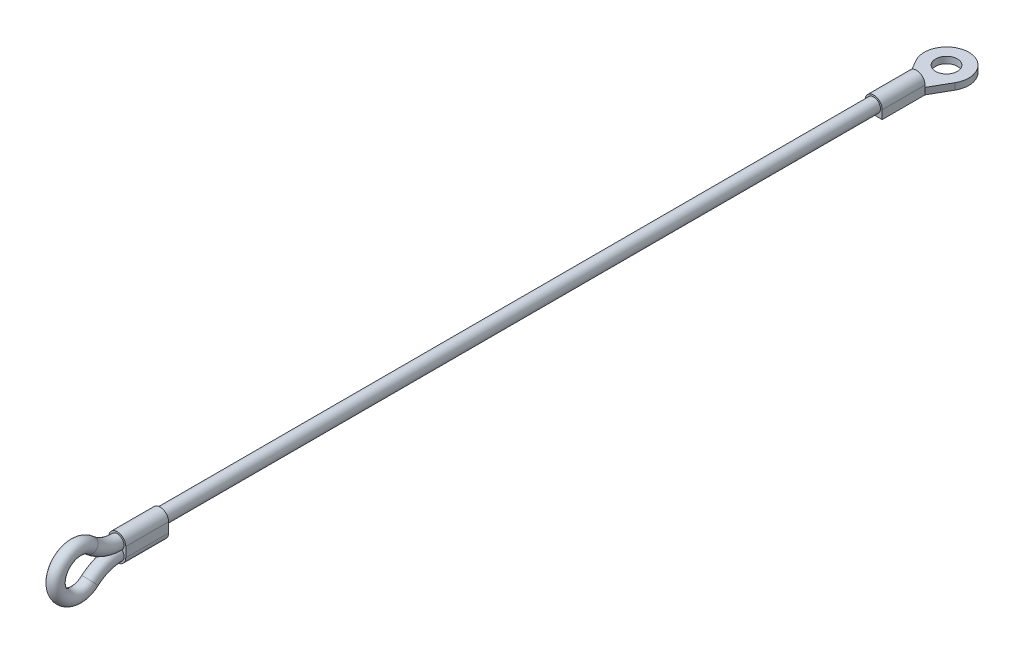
ISO-10303-21;
HEADER;
FILE_DESCRIPTION(('STEP AP214'),'2;1');
FILE_NAME('part.step','',(''),(''),'','','');
FILE_SCHEMA(('AUTOMOTIVE_DESIGN { 1 0 10303 214 1 1 1 1 }'));
ENDSEC;
DATA;
#1=APPLICATION_CONTEXT('core data for automotive mechanical design processes');
#2=APPLICATION_PROTOCOL_DEFINITION('international standard','automotive_design',2000,#1);
#3=PRODUCT_CONTEXT('',#1,'mechanical');
#4=PRODUCT('Part','Part','',(#3));
#5=PRODUCT_RELATED_PRODUCT_CATEGORY('part','',(#4));
#6=PRODUCT_DEFINITION_FORMATION('','',#4);
#7=PRODUCT_DEFINITION_CONTEXT('part definition',#1,'design');
#8=PRODUCT_DEFINITION('design','',#6,#7);
#9=PRODUCT_DEFINITION_SHAPE('','',#8);
#10=(LENGTH_UNIT() NAMED_UNIT(*) SI_UNIT(.MILLI.,.METRE.));
#11=(NAMED_UNIT(*) PLANE_ANGLE_UNIT() SI_UNIT($,.RADIAN.));
#12=(NAMED_UNIT(*) SI_UNIT($,.STERADIAN.) SOLID_ANGLE_UNIT());
#13=UNCERTAINTY_MEASURE_WITH_UNIT(LENGTH_MEASURE(1.E-05),#10,'distance_accuracy_value','');
#14=(GEOMETRIC_REPRESENTATION_CONTEXT(3) GLOBAL_UNCERTAINTY_ASSIGNED_CONTEXT((#13)) GLOBAL_UNIT_ASSIGNED_CONTEXT((#10,
#11,#12)) REPRESENTATION_CONTEXT('',''));
#15=CARTESIAN_POINT('',(0.,0.,0.));
#16=DIRECTION('',(0.,0.,1.));
#17=DIRECTION('',(1.,0.,0.));
#18=AXIS2_PLACEMENT_3D('',#15,#16,#17);
#19=CARTESIAN_POINT('',(0.,0.,-10.));
#20=DIRECTION('',(0.,0.,-1.));
#21=DIRECTION('',(-1.,0.,0.));
#22=AXIS2_PLACEMENT_3D('',#19,#20,#21);
#23=PLANE('',#22);
#24=DIRECTION('',(0.,-1.,0.));
#25=VECTOR('',#24,1.);
#26=CARTESIAN_POINT('',(1.99,0.,-10.));
#27=LINE('',#26,#25);
#28=CARTESIAN_POINT('',(1.99,0.,-10.));
#29=VERTEX_POINT('',#28);
#30=CARTESIAN_POINT('',(1.99,-0.47,-10.));
#31=VERTEX_POINT('',#30);
#32=EDGE_CURVE('E164',#29,#31,#27,.T.);
#33=ORIENTED_EDGE('',*,*,#32,.T.);
#34=DIRECTION('',(-1.,0.,0.));
#35=VECTOR('',#34,1.);
#36=CARTESIAN_POINT('',(-1.99,-0.47,-10.));
#37=LINE('',#36,#35);
#38=CARTESIAN_POINT('',(-1.99,-0.47,-10.));
#39=VERTEX_POINT('',#38);
#40=EDGE_CURVE('E133',#31,#39,#37,.T.);
#41=ORIENTED_EDGE('',*,*,#40,.T.);
#42=DIRECTION('',(0.,1.,0.));
#43=VECTOR('',#42,1.);
#44=CARTESIAN_POINT('',(-1.99,-1.99,-10.));
#45=LINE('',#44,#43);
#46=CARTESIAN_POINT('',(-1.99,0.,-10.));
#47=VERTEX_POINT('',#46);
#48=EDGE_CURVE('E168',#39,#47,#45,.T.);
#49=ORIENTED_EDGE('',*,*,#48,.T.);
#50=CARTESIAN_POINT('',(0.,0.,-10.));
#51=DIRECTION('',(0.,0.,-1.));
#52=DIRECTION('',(-1.,0.,0.));
#53=AXIS2_PLACEMENT_3D('',#50,#51,#52);
#54=CIRCLE('',#53,1.99);
#55=EDGE_CURVE('E161',#47,#29,#54,.T.);
#56=ORIENTED_EDGE('',*,*,#55,.T.);
#57=EDGE_LOOP('',(#33,#41,#49,#56));
#58=FACE_BOUND('',#57,.T.);
#59=ADVANCED_FACE('F33',(#58),#23,.T.);
#60=CARTESIAN_POINT('',(0.,0.,176.6));
#61=DIRECTION('',(0.,0.,-1.));
#62=DIRECTION('',(-1.,0.,0.));
#63=AXIS2_PLACEMENT_3D('',#60,#61,#62);
#64=CYLINDRICAL_SURFACE('',#63,1.59);
#65=CARTESIAN_POINT('',(0.,0.,166.6));
#66=DIRECTION('',(0.,0.,-1.));
#67=DIRECTION('',(0.,1.,0.));
#68=AXIS2_PLACEMENT_3D('',#65,#66,#67);
#69=CIRCLE('',#68,1.59);
#70=CARTESIAN_POINT('',(0.,1.59,166.6));
#71=VERTEX_POINT('',#70);
#72=EDGE_CURVE('E37',#71,#71,#69,.T.);
#73=ORIENTED_EDGE('',*,*,#72,.T.);
#74=EDGE_LOOP('',(#73));
#75=FACE_BOUND('',#74,.T.);
#76=CARTESIAN_POINT('',(0.,0.,0.));
#77=DIRECTION('',(0.,0.,1.));
#78=DIRECTION('',(1.,0.,0.));
#79=AXIS2_PLACEMENT_3D('',#76,#77,#78);
#80=CIRCLE('',#79,1.59);
#81=CARTESIAN_POINT('',(1.59,0.,0.));
#82=VERTEX_POINT('',#81);
#83=EDGE_CURVE('E190',#82,#82,#80,.T.);
#84=ORIENTED_EDGE('',*,*,#83,.T.);
#85=EDGE_LOOP('',(#84));
#86=FACE_BOUND('',#85,.T.);
#87=ADVANCED_FACE('F35',(#75,#86),#64,.T.);
#88=CARTESIAN_POINT('',(0.,4.03872537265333E-12,166.6));
#89=DIRECTION('',(0.,0.,1.));
#90=DIRECTION('',(0.,-1.,0.));
#91=AXIS2_PLACEMENT_3D('',#88,#89,#90);
#92=CYLINDRICAL_SURFACE('',#91,1.99);
#93=CARTESIAN_POINT('',(0.,4.05318140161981E-12,176.6));
#94=DIRECTION('',(0.,0.,-1.));
#95=DIRECTION('',(0.,1.,0.));
#96=AXIS2_PLACEMENT_3D('',#93,#94,#95);
#97=CIRCLE('',#96,1.99);
#98=CARTESIAN_POINT('',(-1.99,4.05342510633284E-12,176.6));
#99=VERTEX_POINT('',#98);
#100=CARTESIAN_POINT('',(1.99,4.05293769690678E-12,176.6));
#101=VERTEX_POINT('',#100);
#102=EDGE_CURVE('E202',#99,#101,#97,.T.);
#103=ORIENTED_EDGE('',*,*,#102,.T.);
#104=DIRECTION('',(0.,0.,1.));
#105=VECTOR('',#104,1.);
#106=CARTESIAN_POINT('',(1.99,4.03848166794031E-12,166.6));
#107=LINE('',#106,#105);
#108=CARTESIAN_POINT('',(1.99,4.03848166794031E-12,166.6));
#109=VERTEX_POINT('',#108);
#110=EDGE_CURVE('E218',#109,#101,#107,.T.);
#111=ORIENTED_EDGE('',*,*,#110,.F.);
#112=CARTESIAN_POINT('',(0.,4.03872537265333E-12,166.6));
#113=DIRECTION('',(0.,0.,-1.));
#114=DIRECTION('',(0.,1.,0.));
#115=AXIS2_PLACEMENT_3D('',#112,#113,#114);
#116=CIRCLE('',#115,1.99);
#117=CARTESIAN_POINT('',(-1.99,4.03896907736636E-12,166.6));
#118=VERTEX_POINT('',#117);
#119=EDGE_CURVE('E191',#118,#109,#116,.T.);
#120=ORIENTED_EDGE('',*,*,#119,.F.);
#121=DIRECTION('',(0.,0.,1.));
#122=VECTOR('',#121,1.);
#123=CARTESIAN_POINT('',(-1.99,4.03896907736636E-12,166.6));
#124=LINE('',#123,#122);
#125=EDGE_CURVE('E201',#118,#99,#124,.T.);
#126=ORIENTED_EDGE('',*,*,#125,.T.);
#127=EDGE_LOOP('',(#103,#111,#120,#126));
#128=FACE_BOUND('',#127,.T.);
#129=ADVANCED_FACE('F244',(#128),#92,.T.);
#130=CARTESIAN_POINT('',(1.99,4.03848166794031E-12,166.6));
#131=DIRECTION('',(-1.,0.,0.));
#132=DIRECTION('',(0.,-1.,0.));
#133=AXIS2_PLACEMENT_3D('',#130,#131,#132);
#134=PLANE('',#133);
#135=DIRECTION('',(0.,-1.,0.));
#136=VECTOR('',#135,1.);
#137=CARTESIAN_POINT('',(1.99,4.05293769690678E-12,176.6));
#138=LINE('',#137,#136);
#139=CARTESIAN_POINT('',(1.99,-2.26625258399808,176.6));
#140=VERTEX_POINT('',#139);
#141=EDGE_CURVE('E205',#101,#140,#138,.T.);
#142=ORIENTED_EDGE('',*,*,#141,.T.);
#143=DIRECTION('',(0.,0.,1.));
#144=VECTOR('',#143,1.);
#145=CARTESIAN_POINT('',(1.99,-2.26625258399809,166.6));
#146=LINE('',#145,#144);
#147=CARTESIAN_POINT('',(1.99,-2.26625258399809,166.6));
#148=VERTEX_POINT('',#147);
#149=EDGE_CURVE('E215',#148,#140,#146,.T.);
#150=ORIENTED_EDGE('',*,*,#149,.F.);
#151=DIRECTION('',(0.,-1.,0.));
#152=VECTOR('',#151,1.);
#153=CARTESIAN_POINT('',(1.99,4.03848166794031E-12,166.6));
#154=LINE('',#153,#152);
#155=EDGE_CURVE('E194',#109,#148,#154,.T.);
#156=ORIENTED_EDGE('',*,*,#155,.F.);
#157=ORIENTED_EDGE('',*,*,#110,.T.);
#158=EDGE_LOOP('',(#142,#150,#156,#157));
#159=FACE_BOUND('',#158,.T.);
#160=ADVANCED_FACE('F296',(#159),#134,.F.);
#161=CARTESIAN_POINT('',(0.,-2.26625258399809,166.6));
#162=DIRECTION('',(0.,0.,1.));
#163=DIRECTION('',(0.,-1.,0.));
#164=AXIS2_PLACEMENT_3D('',#161,#162,#163);
#165=CYLINDRICAL_SURFACE('',#164,1.99);
#166=CARTESIAN_POINT('',(0.,-2.26625258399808,176.6));
#167=DIRECTION('',(0.,0.,-1.));
#168=DIRECTION('',(0.,1.,0.));
#169=AXIS2_PLACEMENT_3D('',#166,#167,#168);
#170=CIRCLE('',#169,1.99);
#171=CARTESIAN_POINT('',(-1.99,-2.26625258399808,176.6));
#172=VERTEX_POINT('',#171);
#173=EDGE_CURVE('E207',#140,#172,#170,.T.);
#174=ORIENTED_EDGE('',*,*,#173,.T.);
#175=DIRECTION('',(0.,0.,1.));
#176=VECTOR('',#175,1.);
#177=CARTESIAN_POINT('',(-1.99,-2.26625258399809,166.6));
#178=LINE('',#177,#176);
#179=CARTESIAN_POINT('',(-1.99,-2.26625258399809,166.6));
#180=VERTEX_POINT('',#179);
#181=EDGE_CURVE('E212',#180,#172,#178,.T.);
#182=ORIENTED_EDGE('',*,*,#181,.F.);
#183=CARTESIAN_POINT('',(0.,-2.26625258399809,166.6));
#184=DIRECTION('',(0.,0.,-1.));
#185=DIRECTION('',(0.,1.,0.));
#186=AXIS2_PLACEMENT_3D('',#183,#184,#185);
#187=CIRCLE('',#186,1.99);
#188=EDGE_CURVE('E197',#148,#180,#187,.T.);
#189=ORIENTED_EDGE('',*,*,#188,.F.);
#190=ORIENTED_EDGE('',*,*,#149,.T.);
#191=EDGE_LOOP('',(#174,#182,#189,#190));
#192=FACE_BOUND('',#191,.T.);
#193=ADVANCED_FACE('F293',(#192),#165,.T.);
#194=CARTESIAN_POINT('',(-1.99,4.03896907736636E-12,166.6));
#195=DIRECTION('',(1.,0.,0.));
#196=DIRECTION('',(0.,1.,0.));
#197=AXIS2_PLACEMENT_3D('',#194,#195,#196);
#198=PLANE('',#197);
#199=DIRECTION('',(0.,1.,0.));
#200=VECTOR('',#199,1.);
#201=CARTESIAN_POINT('',(-1.99,4.05342510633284E-12,176.6));
#202=LINE('',#201,#200);
#203=EDGE_CURVE('E195',#172,#99,#202,.T.);
#204=ORIENTED_EDGE('',*,*,#203,.T.);
#205=ORIENTED_EDGE('',*,*,#125,.F.);
#206=DIRECTION('',(0.,1.,0.));
#207=VECTOR('',#206,1.);
#208=CARTESIAN_POINT('',(-1.99,4.03896907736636E-12,166.6));
#209=LINE('',#208,#207);
#210=EDGE_CURVE('E199',#180,#118,#209,.T.);
#211=ORIENTED_EDGE('',*,*,#210,.F.);
#212=ORIENTED_EDGE('',*,*,#181,.T.);
#213=EDGE_LOOP('',(#204,#205,#211,#212));
#214=FACE_BOUND('',#213,.T.);
#215=ADVANCED_FACE('F288',(#214),#198,.F.);
#216=CARTESIAN_POINT('',(0.,4.03872537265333E-12,166.6));
#217=DIRECTION('',(0.,0.,-1.));
#218=DIRECTION('',(0.,1.,0.));
#219=AXIS2_PLACEMENT_3D('',#216,#217,#218);
#220=PLANE('',#219);
#221=ORIENTED_EDGE('',*,*,#72,.F.);
#222=EDGE_LOOP('',(#221));
#223=FACE_BOUND('',#222,.T.);
#224=ORIENTED_EDGE('',*,*,#119,.T.);
#225=ORIENTED_EDGE('',*,*,#155,.T.);
#226=ORIENTED_EDGE('',*,*,#188,.T.);
#227=ORIENTED_EDGE('',*,*,#210,.T.);
#228=EDGE_LOOP('',(#224,#225,#226,#227));
#229=FACE_BOUND('',#228,.T.);
#230=ADVANCED_FACE('F255',(#223,#229),#220,.T.);
#231=CARTESIAN_POINT('',(0.,4.05318140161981E-12,176.6));
#232=DIRECTION('',(0.,0.,-1.));
#233=DIRECTION('',(0.,1.,0.));
#234=AXIS2_PLACEMENT_3D('',#231,#232,#233);
#235=PLANE('',#234);
#236=CARTESIAN_POINT('',(0.,0.,176.6));
#237=DIRECTION('',(0.,0.,1.));
#238=DIRECTION('',(1.,0.,0.));
#239=AXIS2_PLACEMENT_3D('',#236,#237,#238);
#240=CIRCLE('',#239,1.59);
#241=CARTESIAN_POINT('',(1.11540342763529,-1.13312629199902,176.6));
#242=VERTEX_POINT('',#241);
#243=CARTESIAN_POINT('',(-1.11540342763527,-1.13312629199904,176.6));
#244=VERTEX_POINT('',#243);
#245=EDGE_CURVE('E42',#242,#244,#240,.T.);
#246=ORIENTED_EDGE('',*,*,#245,.F.);
#247=CARTESIAN_POINT('',(0.,-2.26625258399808,176.6));
#248=DIRECTION('',(0.,0.,-1.));
#249=DIRECTION('',(1.,0.,0.));
#250=AXIS2_PLACEMENT_3D('',#247,#248,#249);
#251=CIRCLE('',#250,1.59);
#252=EDGE_CURVE('E56',#242,#244,#251,.T.);
#253=ORIENTED_EDGE('',*,*,#252,.T.);
#254=EDGE_LOOP('',(#246,#253));
#255=FACE_BOUND('',#254,.T.);
#256=ORIENTED_EDGE('',*,*,#102,.F.);
#257=ORIENTED_EDGE('',*,*,#203,.F.);
#258=ORIENTED_EDGE('',*,*,#173,.F.);
#259=ORIENTED_EDGE('',*,*,#141,.F.);
#260=EDGE_LOOP('',(#256,#257,#258,#259));
#261=FACE_BOUND('',#260,.T.);
#262=ADVANCED_FACE('F248',(#255,#261),#235,.F.);
#263=CARTESIAN_POINT('',(0.,-1.13312629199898,186.2));
#264=DIRECTION('',(-1.,0.,0.));
#265=DIRECTION('',(0.,0.,1.));
#266=AXIS2_PLACEMENT_3D('',#263,#264,#265);
#267=TOROIDAL_SURFACE('',#266,4.79999999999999,1.59);
#268=CARTESIAN_POINT('',(0.,-4.71083505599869,183.));
#269=DIRECTION('',(0.,0.666666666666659,-0.745355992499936));
#270=DIRECTION('',(1.,0.,0.));
#271=AXIS2_PLACEMENT_3D('',#268,#269,#270);
#272=CIRCLE('',#271,1.59);
#273=CARTESIAN_POINT('',(0.,-5.89595108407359,181.94));
#274=VERTEX_POINT('',#273);
#275=EDGE_CURVE('E222',#274,#274,#272,.T.);
#276=CARTESIAN_POINT('',(0.,2.44458247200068,183.));
#277=DIRECTION('',(0.,0.666666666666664,0.745355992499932));
#278=DIRECTION('',(1.,0.,0.));
#279=AXIS2_PLACEMENT_3D('',#276,#277,#278);
#280=CIRCLE('',#279,1.59);
#281=CARTESIAN_POINT('',(0.,3.62969850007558,181.94));
#282=VERTEX_POINT('',#281);
#283=EDGE_CURVE('E225',#282,#282,#280,.T.);
#284=CARTESIAN_POINT('',(0.,-1.13312629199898,186.2));
#285=DIRECTION('',(-1.,0.,0.));
#286=DIRECTION('',(0.,0.,1.));
#287=AXIS2_PLACEMENT_3D('',#284,#285,#286);
#288=CIRCLE('',#287,6.38999999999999);
#289=EDGE_CURVE('',#274,#282,#288,.T.);
#290=ORIENTED_EDGE('',*,*,#275,.F.);
#291=ORIENTED_EDGE('',*,*,#283,.T.);
#292=ORIENTED_EDGE('',*,*,#289,.T.);
#293=ORIENTED_EDGE('',*,*,#289,.F.);
#294=EDGE_LOOP('',(#290,#292,#291,#293));
#295=FACE_BOUND('',#294,.T.);
#296=ADVANCED_FACE('F246',(#295),#267,.T.);
#297=CARTESIAN_POINT('',(0.,9.6,176.6));
#298=DIRECTION('',(1.,0.,0.));
#299=DIRECTION('',(0.,0.,-1.));
#300=AXIS2_PLACEMENT_3D('',#297,#298,#299);
#301=TOROIDAL_SURFACE('',#300,9.6,1.59);
#302=ORIENTED_EDGE('',*,*,#283,.F.);
#303=EDGE_LOOP('',(#302));
#304=FACE_BOUND('',#303,.T.);
#305=CARTESIAN_POINT('',(1.11540342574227,-1.13312629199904,176.5998));
#306=CARTESIAN_POINT('',(1.11534851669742,-1.13312629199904,176.72773673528));
#307=CARTESIAN_POINT('',(1.11308141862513,-1.13312629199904,176.855686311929));
#308=CARTESIAN_POINT('',(1.10371453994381,-1.13312629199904,177.11155828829));
#309=CARTESIAN_POINT('',(1.0966090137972,-1.13312629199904,177.23948047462));
#310=CARTESIAN_POINT('',(1.07704253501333,-1.13312629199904,177.496418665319));
#311=CARTESIAN_POINT('',(1.06452051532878,-1.13312629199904,177.625430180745));
#312=CARTESIAN_POINT('',(1.0331943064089,-1.13312629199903,177.882627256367));
#313=CARTESIAN_POINT('',(1.01439338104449,-1.13312629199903,178.010813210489));
#314=CARTESIAN_POINT('',(0.966908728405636,-1.13312629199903,178.278005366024));
#315=CARTESIAN_POINT('',(0.937456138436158,-1.13312629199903,178.416883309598));
#316=CARTESIAN_POINT('',(0.883915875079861,-1.13312629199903,178.62263125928));
#317=CARTESIAN_POINT('',(0.864530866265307,-1.13312629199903,178.690724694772));
#318=CARTESIAN_POINT('',(0.821996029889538,-1.13312629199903,178.825715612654));
#319=CARTESIAN_POINT('',(0.79884765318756,-1.13312629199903,178.892613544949));
#320=CARTESIAN_POINT('',(0.744519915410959,-1.13312629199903,179.033542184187));
#321=CARTESIAN_POINT('',(0.712679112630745,-1.13312629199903,179.107321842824));
#322=CARTESIAN_POINT('',(0.641279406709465,-1.13312629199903,179.251146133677));
#323=CARTESIAN_POINT('',(0.601727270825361,-1.13312629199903,179.321193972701));
#324=CARTESIAN_POINT('',(0.528948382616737,-1.13312629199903,179.42943568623));
#325=CARTESIAN_POINT('',(0.498892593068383,-1.13312629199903,179.469741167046));
#326=CARTESIAN_POINT('',(0.43377002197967,-1.13312629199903,179.5461405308));
#327=CARTESIAN_POINT('',(0.398710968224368,-1.13312629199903,179.582240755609));
#328=CARTESIAN_POINT('',(0.335060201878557,-1.13312629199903,179.637058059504));
#329=CARTESIAN_POINT('',(0.308066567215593,-1.13312629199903,179.657612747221));
#330=CARTESIAN_POINT('',(0.251279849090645,-1.13312629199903,179.694433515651));
#331=CARTESIAN_POINT('',(0.221491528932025,-1.13312629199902,179.710706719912));
#332=CARTESIAN_POINT('',(0.165682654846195,-1.13312629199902,179.734797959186));
#333=CARTESIAN_POINT('',(0.140117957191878,-1.13312629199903,179.743660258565));
#334=CARTESIAN_POINT('',(0.0878641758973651,-1.13312629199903,179.756990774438));
#335=CARTESIAN_POINT('',(0.061176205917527,-1.13312629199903,179.761463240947));
#336=CARTESIAN_POINT('',(0.00731772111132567,-1.13312629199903,179.765572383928));
#337=CARTESIAN_POINT('',(-0.0198542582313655,-1.13312629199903,179.765190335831));
#338=CARTESIAN_POINT('',(-0.0736951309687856,-1.13312629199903,179.759586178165));
#339=CARTESIAN_POINT('',(-0.100363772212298,-1.13312629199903,179.754361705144));
#340=CARTESIAN_POINT('',(-0.151195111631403,-1.13312629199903,179.739957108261));
#341=CARTESIAN_POINT('',(-0.17541664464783,-1.13312629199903,179.730979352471));
#342=CARTESIAN_POINT('',(-0.222373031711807,-1.13312629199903,179.709774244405));
#343=CARTESIAN_POINT('',(-0.245107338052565,-1.13312629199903,179.697545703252));
#344=CARTESIAN_POINT('',(-0.304759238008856,-1.13312629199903,179.660748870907));
#345=CARTESIAN_POINT('',(-0.34010194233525,-1.13312629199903,179.633635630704));
#346=CARTESIAN_POINT('',(-0.406281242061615,-1.13312629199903,179.57436880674));
#347=CARTESIAN_POINT('',(-0.43710254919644,-1.13312629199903,179.542198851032));
#348=CARTESIAN_POINT('',(-0.4927185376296,-1.13312629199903,179.47701365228));
#349=CARTESIAN_POINT('',(-0.517788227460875,-1.13312629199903,179.444229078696));
#350=CARTESIAN_POINT('',(-0.565060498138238,-1.13312629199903,179.376639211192));
#351=CARTESIAN_POINT('',(-0.587260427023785,-1.13312629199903,179.341832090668));
#352=CARTESIAN_POINT('',(-0.650275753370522,-1.13312629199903,179.235150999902));
#353=CARTESIAN_POINT('',(-0.687428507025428,-1.13312629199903,179.161116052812));
#354=CARTESIAN_POINT('',(-0.745434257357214,-1.13312629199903,179.030275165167));
#355=CARTESIAN_POINT('',(-0.767985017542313,-1.13312629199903,178.974182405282));
#356=CARTESIAN_POINT('',(-0.809859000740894,-1.13312629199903,178.860796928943));
#357=CARTESIAN_POINT('',(-0.829181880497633,-1.13312629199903,178.803504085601));
#358=CARTESIAN_POINT('',(-0.883166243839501,-1.13312629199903,178.630173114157));
#359=CARTESIAN_POINT('',(-0.913763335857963,-1.13312629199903,178.512874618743));
#360=CARTESIAN_POINT('',(-0.967023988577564,-1.13312629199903,178.275955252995));
#361=CARTESIAN_POINT('',(-0.98964704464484,-1.13312629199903,178.156325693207));
#362=CARTESIAN_POINT('',(-1.02845868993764,-1.13312629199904,177.916012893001));
#363=CARTESIAN_POINT('',(-1.04464572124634,-1.13312629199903,177.795329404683));
#364=CARTESIAN_POINT('',(-1.06818793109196,-1.13312629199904,177.58453669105));
#365=CARTESIAN_POINT('',(-1.07674400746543,-1.13312629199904,177.494556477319));
#366=CARTESIAN_POINT('',(-1.09119671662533,-1.13312629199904,177.314367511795));
#367=CARTESIAN_POINT('',(-1.09709289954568,-1.13312629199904,177.224158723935));
#368=CARTESIAN_POINT('',(-1.10635885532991,-1.13312629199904,177.044939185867));
#369=CARTESIAN_POINT('',(-1.10976438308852,-1.13312629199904,176.955930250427));
#370=CARTESIAN_POINT('',(-1.11428069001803,-1.13312629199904,176.777880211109));
#371=CARTESIAN_POINT('',(-1.11539214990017,-1.13312629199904,176.688839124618));
#372=CARTESIAN_POINT('',(-1.11540342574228,-1.13312629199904,176.5998));
#373=B_SPLINE_CURVE_WITH_KNOTS('',3,(#305,#306,#307,#308,#309,#310,#311,#312,#313,#314,#315,
#316,#317,#318,#319,#320,#321,#322,#323,#324,#325,#326,#327,#328,#329,#330,#331,#332,#333,#334,
#335,#336,#337,#338,#339,#340,#341,#342,#343,#344,#345,#346,#347,#348,#349,#350,#351,#352,#353,
#354,#355,#356,#357,#358,#359,#360,#361,#362,#363,#364,#365,#366,#367,#368,#369,#370,#371,#372),
.UNSPECIFIED.,.F.,.F.,(4,2,2,2,2,2,2,2,2,2,2,2,2,2,2,2,2,2,2,2,2,2,2,2,2,2,2,2,2,2,2,2,2,4),(0.,
0.383810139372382,0.768076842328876,1.15679365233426,1.54530871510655,1.97071269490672,
2.18302701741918,2.39525968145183,2.63604166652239,2.87661329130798,3.02716706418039,
3.17749076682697,3.27898827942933,3.38031583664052,3.46115731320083,3.54192044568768,
3.62299518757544,3.70410952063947,3.78132200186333,3.85856276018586,3.99142265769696,
4.12472192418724,4.24834991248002,4.3720913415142,4.61994843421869,4.80123584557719,
4.98254252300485,5.34577733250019,5.71083149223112,6.07597396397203,6.34709439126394,
6.6182606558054,6.88545336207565,7.15256677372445),.UNSPECIFIED.);
#374=EDGE_CURVE('E11',#242,#244,#373,.T.);
#375=ORIENTED_EDGE('',*,*,#374,.F.);
#376=ORIENTED_EDGE('',*,*,#245,.T.);
#377=EDGE_LOOP('',(#375,#376));
#378=FACE_BOUND('',#377,.T.);
#379=ADVANCED_FACE('F235',(#304,#378),#301,.T.);
#380=CARTESIAN_POINT('',(0.,-11.8662525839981,176.6));
#381=DIRECTION('',(1.,0.,0.));
#382=DIRECTION('',(0.,0.,-1.));
#383=AXIS2_PLACEMENT_3D('',#380,#381,#382);
#384=TOROIDAL_SURFACE('',#383,9.6,1.59);
#385=ORIENTED_EDGE('',*,*,#275,.T.);
#386=EDGE_LOOP('',(#385));
#387=FACE_BOUND('',#386,.T.);
#388=ORIENTED_EDGE('',*,*,#252,.F.);
#389=ORIENTED_EDGE('',*,*,#374,.T.);
#390=EDGE_LOOP('',(#388,#389));
#391=FACE_BOUND('',#390,.T.);
#392=ADVANCED_FACE('F238',(#387,#391),#384,.T.);
#393=CARTESIAN_POINT('',(0.,0.,-10.));
#394=DIRECTION('',(0.,0.,1.));
#395=DIRECTION('',(1.,0.,0.));
#396=AXIS2_PLACEMENT_3D('',#393,#394,#395);
#397=CYLINDRICAL_SURFACE('',#396,1.99);
#398=CARTESIAN_POINT('',(0.,0.,0.));
#399=DIRECTION('',(0.,0.,-1.));
#400=DIRECTION('',(-1.,0.,0.));
#401=AXIS2_PLACEMENT_3D('',#398,#399,#400);
#402=CIRCLE('',#401,1.99);
#403=CARTESIAN_POINT('',(-1.99,0.,0.));
#404=VERTEX_POINT('',#403);
#405=CARTESIAN_POINT('',(1.99,0.,0.));
#406=VERTEX_POINT('',#405);
#407=EDGE_CURVE('E159',#404,#406,#402,.T.);
#408=ORIENTED_EDGE('',*,*,#407,.T.);
#409=DIRECTION('',(0.,0.,1.));
#410=VECTOR('',#409,1.);
#411=CARTESIAN_POINT('',(1.99,0.,-10.));
#412=LINE('',#411,#410);
#413=EDGE_CURVE('E187',#29,#406,#412,.T.);
#414=ORIENTED_EDGE('',*,*,#413,.F.);
#415=ORIENTED_EDGE('',*,*,#55,.F.);
#416=DIRECTION('',(0.,0.,1.));
#417=VECTOR('',#416,1.);
#418=CARTESIAN_POINT('',(-1.99,0.,-10.));
#419=LINE('',#418,#417);
#420=EDGE_CURVE('E170',#47,#404,#419,.T.);
#421=ORIENTED_EDGE('',*,*,#420,.T.);
#422=EDGE_LOOP('',(#408,#414,#415,#421));
#423=FACE_BOUND('',#422,.T.);
#424=ADVANCED_FACE('F242',(#423),#397,.T.);
#425=CARTESIAN_POINT('',(1.99,0.,-10.));
#426=DIRECTION('',(-1.,0.,0.));
#427=DIRECTION('',(0.,-1.,0.));
#428=AXIS2_PLACEMENT_3D('',#425,#426,#427);
#429=PLANE('',#428);
#430=DIRECTION('',(0.,-1.,0.));
#431=VECTOR('',#430,1.);
#432=CARTESIAN_POINT('',(1.99,0.,0.));
#433=LINE('',#432,#431);
#434=CARTESIAN_POINT('',(1.99,-1.99,0.));
#435=VERTEX_POINT('',#434);
#436=EDGE_CURVE('E173',#406,#435,#433,.T.);
#437=ORIENTED_EDGE('',*,*,#436,.T.);
#438=DIRECTION('',(0.,0.,1.));
#439=VECTOR('',#438,1.);
#440=CARTESIAN_POINT('',(1.99,-1.99,-10.));
#441=LINE('',#440,#439);
#442=CARTESIAN_POINT('',(1.99,-1.99,-10.));
#443=VERTEX_POINT('',#442);
#444=EDGE_CURVE('E184',#443,#435,#441,.T.);
#445=ORIENTED_EDGE('',*,*,#444,.F.);
#446=DIRECTION('',(0.,-1.,0.));
#447=VECTOR('',#446,1.);
#448=CARTESIAN_POINT('',(1.99,-0.47,-10.));
#449=LINE('',#448,#447);
#450=EDGE_CURVE('E157',#31,#443,#449,.T.);
#451=ORIENTED_EDGE('',*,*,#450,.F.);
#452=ORIENTED_EDGE('',*,*,#32,.F.);
#453=ORIENTED_EDGE('',*,*,#413,.T.);
#454=EDGE_LOOP('',(#437,#445,#451,#452,#453));
#455=FACE_BOUND('',#454,.T.);
#456=ADVANCED_FACE('F279',(#455),#429,.F.);
#457=CARTESIAN_POINT('',(0.,-1.99,-10.));
#458=DIRECTION('',(0.,1.,0.));
#459=DIRECTION('',(0.,0.,1.));
#460=AXIS2_PLACEMENT_3D('',#457,#458,#459);
#461=PLANE('',#460);
#462=DIRECTION('',(-1.,0.,0.));
#463=VECTOR('',#462,1.);
#464=CARTESIAN_POINT('',(0.,-1.99,0.));
#465=LINE('',#464,#463);
#466=CARTESIAN_POINT('',(-1.99,-1.99,0.));
#467=VERTEX_POINT('',#466);
#468=EDGE_CURVE('E176',#435,#467,#465,.T.);
#469=ORIENTED_EDGE('',*,*,#468,.T.);
#470=DIRECTION('',(0.,0.,1.));
#471=VECTOR('',#470,1.);
#472=CARTESIAN_POINT('',(-1.99,-1.99,-10.));
#473=LINE('',#472,#471);
#474=CARTESIAN_POINT('',(-1.99,-1.99,-10.));
#475=VERTEX_POINT('',#474);
#476=EDGE_CURVE('E181',#475,#467,#473,.T.);
#477=ORIENTED_EDGE('',*,*,#476,.F.);
#478=DIRECTION('',(-0.496859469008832,0.,-0.867831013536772));
#479=VECTOR('',#478,1.);
#480=CARTESIAN_POINT('',(-4.5170604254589,-1.99,-14.413846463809));
#481=LINE('',#480,#479);
#482=CARTESIAN_POINT('',(-4.5170604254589,-1.99,-14.413846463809));
#483=VERTEX_POINT('',#482);
#484=EDGE_CURVE('E153',#475,#483,#481,.T.);
#485=ORIENTED_EDGE('',*,*,#484,.T.);
#486=CARTESIAN_POINT('',(0.,-1.99,-17.));
#487=DIRECTION('',(0.,-1.,0.));
#488=DIRECTION('',(0.,0.,1.));
#489=AXIS2_PLACEMENT_3D('',#486,#487,#488);
#490=CIRCLE('',#489,5.205);
#491=CARTESIAN_POINT('',(4.5170604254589,-1.99,-14.413846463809));
#492=VERTEX_POINT('',#491);
#493=EDGE_CURVE('E129',#483,#492,#490,.T.);
#494=ORIENTED_EDGE('',*,*,#493,.T.);
#495=DIRECTION('',(-0.496859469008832,0.,0.867831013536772));
#496=VECTOR('',#495,1.);
#497=CARTESIAN_POINT('',(1.99,-1.99,-10.));
#498=LINE('',#497,#496);
#499=EDGE_CURVE('E143',#492,#443,#498,.T.);
#500=ORIENTED_EDGE('',*,*,#499,.T.);
#501=ORIENTED_EDGE('',*,*,#444,.T.);
#502=EDGE_LOOP('',(#469,#477,#485,#494,#500,#501));
#503=FACE_BOUND('',#502,.T.);
#504=CARTESIAN_POINT('',(0.,-1.99,-17.));
#505=DIRECTION('',(0.,-1.,0.));
#506=DIRECTION('',(0.,0.,-1.));
#507=AXIS2_PLACEMENT_3D('',#504,#505,#506);
#508=CIRCLE('',#507,2.54);
#509=CARTESIAN_POINT('',(0.,-1.99,-19.54));
#510=VERTEX_POINT('',#509);
#511=EDGE_CURVE('E148',#510,#510,#508,.T.);
#512=ORIENTED_EDGE('',*,*,#511,.F.);
#513=EDGE_LOOP('',(#512));
#514=FACE_BOUND('',#513,.T.);
#515=ADVANCED_FACE('F275',(#503,#514),#461,.F.);
#516=CARTESIAN_POINT('',(-1.99,-1.99,-10.));
#517=DIRECTION('',(1.,0.,0.));
#518=DIRECTION('',(0.,1.,0.));
#519=AXIS2_PLACEMENT_3D('',#516,#517,#518);
#520=PLANE('',#519);
#521=DIRECTION('',(0.,1.,0.));
#522=VECTOR('',#521,1.);
#523=CARTESIAN_POINT('',(-1.99,-1.99,0.));
#524=LINE('',#523,#522);
#525=EDGE_CURVE('E165',#467,#404,#524,.T.);
#526=ORIENTED_EDGE('',*,*,#525,.T.);
#527=ORIENTED_EDGE('',*,*,#420,.F.);
#528=ORIENTED_EDGE('',*,*,#48,.F.);
#529=EDGE_CURVE('E141',#475,#39,#45,.T.);
#530=ORIENTED_EDGE('',*,*,#529,.F.);
#531=ORIENTED_EDGE('',*,*,#476,.T.);
#532=EDGE_LOOP('',(#526,#527,#528,#530,#531));
#533=FACE_BOUND('',#532,.T.);
#534=ADVANCED_FACE('F271',(#533),#520,.F.);
#535=CARTESIAN_POINT('',(0.,0.,0.));
#536=DIRECTION('',(0.,0.,-1.));
#537=DIRECTION('',(-1.,0.,0.));
#538=AXIS2_PLACEMENT_3D('',#535,#536,#537);
#539=PLANE('',#538);
#540=ORIENTED_EDGE('',*,*,#83,.F.);
#541=EDGE_LOOP('',(#540));
#542=FACE_BOUND('',#541,.T.);
#543=ORIENTED_EDGE('',*,*,#407,.F.);
#544=ORIENTED_EDGE('',*,*,#525,.F.);
#545=ORIENTED_EDGE('',*,*,#468,.F.);
#546=ORIENTED_EDGE('',*,*,#436,.F.);
#547=EDGE_LOOP('',(#543,#544,#545,#546));
#548=FACE_BOUND('',#547,.T.);
#549=ADVANCED_FACE('F268',(#542,#548),#539,.F.);
#550=CARTESIAN_POINT('',(-4.5170604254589,-0.47,-14.413846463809));
#551=DIRECTION('',(-0.867831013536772,0.,0.496859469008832));
#552=DIRECTION('',(0.496859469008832,0.,0.867831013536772));
#553=AXIS2_PLACEMENT_3D('',#550,#551,#552);
#554=PLANE('',#553);
#555=ORIENTED_EDGE('',*,*,#484,.F.);
#556=ORIENTED_EDGE('',*,*,#529,.T.);
#557=DIRECTION('',(-0.496859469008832,0.,-0.867831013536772));
#558=VECTOR('',#557,1.);
#559=CARTESIAN_POINT('',(-4.5170604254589,-0.47,-14.413846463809));
#560=LINE('',#559,#558);
#561=CARTESIAN_POINT('',(-4.5170604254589,-0.47,-14.413846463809));
#562=VERTEX_POINT('',#561);
#563=EDGE_CURVE('E49',#39,#562,#560,.T.);
#564=ORIENTED_EDGE('',*,*,#563,.T.);
#565=DIRECTION('',(0.,-1.,0.));
#566=VECTOR('',#565,1.);
#567=CARTESIAN_POINT('',(-4.5170604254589,-0.47,-14.413846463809));
#568=LINE('',#567,#566);
#569=EDGE_CURVE('E125',#562,#483,#568,.T.);
#570=ORIENTED_EDGE('',*,*,#569,.T.);
#571=EDGE_LOOP('',(#555,#556,#564,#570));
#572=FACE_BOUND('',#571,.T.);
#573=ADVANCED_FACE('F139',(#572),#554,.T.);
#574=CARTESIAN_POINT('',(1.99,-0.47,-10.));
#575=DIRECTION('',(0.867831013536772,0.,0.496859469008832));
#576=DIRECTION('',(0.496859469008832,0.,-0.867831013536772));
#577=AXIS2_PLACEMENT_3D('',#574,#575,#576);
#578=PLANE('',#577);
#579=ORIENTED_EDGE('',*,*,#499,.F.);
#580=DIRECTION('',(0.,-1.,0.));
#581=VECTOR('',#580,1.);
#582=CARTESIAN_POINT('',(4.5170604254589,-0.47,-14.413846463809));
#583=LINE('',#582,#581);
#584=CARTESIAN_POINT('',(4.5170604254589,-0.47,-14.413846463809));
#585=VERTEX_POINT('',#584);
#586=EDGE_CURVE('E132',#585,#492,#583,.T.);
#587=ORIENTED_EDGE('',*,*,#586,.F.);
#588=DIRECTION('',(-0.496859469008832,0.,0.867831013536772));
#589=VECTOR('',#588,1.);
#590=CARTESIAN_POINT('',(1.99,-0.47,-10.));
#591=LINE('',#590,#589);
#592=EDGE_CURVE('E137',#585,#31,#591,.T.);
#593=ORIENTED_EDGE('',*,*,#592,.T.);
#594=ORIENTED_EDGE('',*,*,#450,.T.);
#595=EDGE_LOOP('',(#579,#587,#593,#594));
#596=FACE_BOUND('',#595,.T.);
#597=ADVANCED_FACE('F412',(#596),#578,.T.);
#598=CARTESIAN_POINT('',(0.,-0.47,-17.));
#599=DIRECTION('',(0.,-1.,0.));
#600=DIRECTION('',(0.,0.,-1.));
#601=AXIS2_PLACEMENT_3D('',#598,#599,#600);
#602=CYLINDRICAL_SURFACE('',#601,5.205);
#603=ORIENTED_EDGE('',*,*,#493,.F.);
#604=ORIENTED_EDGE('',*,*,#569,.F.);
#605=CARTESIAN_POINT('',(0.,-0.47,-17.));
#606=DIRECTION('',(0.,-1.,0.));
#607=DIRECTION('',(0.,0.,1.));
#608=AXIS2_PLACEMENT_3D('',#605,#606,#607);
#609=CIRCLE('',#608,5.205);
#610=EDGE_CURVE('E127',#562,#585,#609,.T.);
#611=ORIENTED_EDGE('',*,*,#610,.T.);
#612=ORIENTED_EDGE('',*,*,#586,.T.);
#613=EDGE_LOOP('',(#603,#604,#611,#612));
#614=FACE_BOUND('',#613,.T.);
#615=ADVANCED_FACE('F126',(#614),#602,.T.);
#616=CARTESIAN_POINT('',(0.,-0.47,-17.));
#617=DIRECTION('',(0.,1.,0.));
#618=DIRECTION('',(0.,0.,1.));
#619=AXIS2_PLACEMENT_3D('',#616,#617,#618);
#620=PLANE('',#619);
#621=CARTESIAN_POINT('',(0.,-0.47,-17.));
#622=DIRECTION('',(0.,-1.,0.));
#623=DIRECTION('',(0.,0.,-1.));
#624=AXIS2_PLACEMENT_3D('',#621,#622,#623);
#625=CIRCLE('',#624,2.54);
#626=CARTESIAN_POINT('',(0.,-0.47,-19.54));
#627=VERTEX_POINT('',#626);
#628=EDGE_CURVE('E155',#627,#627,#625,.T.);
#629=ORIENTED_EDGE('',*,*,#628,.T.);
#630=EDGE_LOOP('',(#629));
#631=FACE_BOUND('',#630,.T.);
#632=ORIENTED_EDGE('',*,*,#563,.F.);
#633=ORIENTED_EDGE('',*,*,#40,.F.);
#634=ORIENTED_EDGE('',*,*,#592,.F.);
#635=ORIENTED_EDGE('',*,*,#610,.F.);
#636=EDGE_LOOP('',(#632,#633,#634,#635));
#637=FACE_BOUND('',#636,.T.);
#638=ADVANCED_FACE('F136',(#631,#637),#620,.T.);
#639=CARTESIAN_POINT('',(0.,-0.47,-17.));
#640=DIRECTION('',(0.,-1.,0.));
#641=DIRECTION('',(0.,0.,-1.));
#642=AXIS2_PLACEMENT_3D('',#639,#640,#641);
#643=CYLINDRICAL_SURFACE('',#642,2.54);
#644=ORIENTED_EDGE('',*,*,#628,.F.);
#645=EDGE_LOOP('',(#644));
#646=FACE_BOUND('',#645,.T.);
#647=ORIENTED_EDGE('',*,*,#511,.T.);
#648=EDGE_LOOP('',(#647));
#649=FACE_BOUND('',#648,.T.);
#650=ADVANCED_FACE('F429',(#646,#649),#643,.F.);
#651=CLOSED_SHELL('',(#59,#87,#129,#160,#193,#215,#230,#262,#296,#379,#392,#424,#456,#515,#534,
#549,#573,#597,#615,#638,#650));
#652=MANIFOLD_SOLID_BREP('B2',#651);
#653=ADVANCED_BREP_SHAPE_REPRESENTATION('',(#18,#652),#14);
#654=SHAPE_DEFINITION_REPRESENTATION(#9,#653);
ENDSEC;
END-ISO-10303-21;
